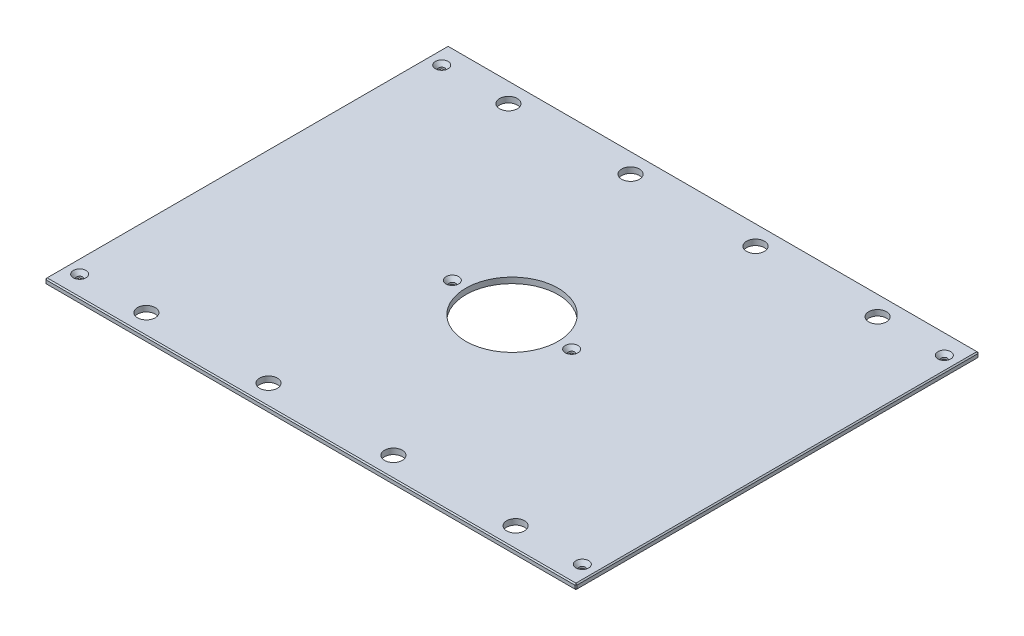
from build123d import *

# Parameters (mm, degrees)
SKETCH1_W                                     = 593.725
SKETCH1_H                                     = 450.85
BOSS_EXTRUDE1_DEPTH                           = 6.35
SKETCH13_R                                    = 51.562
CUT_EXTRUDE6_DEPTH                            = 373.805709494
F_25_32_0_78125_DIAMETER_HOLE1_D              = 19.84375
CHAMFER2_SIZE                                 = 1.27
CSK_FOR_1_4_FLAT_HEAD_MACHINE_SCREW1_AT_COUNT = 2
CSK_FOR_1_4_FLAT_HEAD_MACHINE_SCREW1_AT_PITCH = 404.80996
CSK_FOR_1_4_FLAT_HEAD_MACHINE_SCREW1_2_COUNT  = 2
CSK_FOR_1_4_FLAT_HEAD_MACHINE_SCREW1_2_PITCH  = 692.594401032
CSK_FOR_1_4_FLAT_HEAD_MACHINE_SCREW1_3_COUNT  = 2
CSK_FOR_1_4_FLAT_HEAD_MACHINE_SCREW1_3_PITCH  = 402.289683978
CSK_FOR_1_4_FLAT_HEAD_MACHINE_SCREW1_4_COUNT  = 2
CSK_FOR_1_4_FLAT_HEAD_MACHINE_SCREW1_4_PITCH  = 294.784028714
CSK_FOR_1_4_FLAT_HEAD_MACHINE_SCREW1_5_COUNT  = 2
CSK_FOR_1_4_FLAT_HEAD_MACHINE_SCREW1_5_PITCH  = 561.975
CSK_FOR_1_4_FLAT_HEAD_MACHINE_SCREW1_6_COUNT  = 2
CSK_FOR_1_4_FLAT_HEAD_MACHINE_SCREW1_6_PITCH  = 487.3625
CSK_FOR_1_4_FLAT_HEAD_MACHINE_SCREW1_7_COUNT  = 2
CSK_FOR_1_4_FLAT_HEAD_MACHINE_SCREW1_7_PITCH  = 633.556082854


with BuildPart() as part:
    # Sketch1 → Boss-Extrude1 (new body)
    with BuildSketch(Plane(origin=(0, 0, 0), x_dir=(1, 0, 0), z_dir=(0, 1, 0))):
        Rectangle(SKETCH1_W, SKETCH1_H)
    extrude(amount=BOSS_EXTRUDE1_DEPTH)

    # Sketch13 → Cut-Extrude6 (cut, through all)
    with BuildSketch(Plane(origin=(0, 6.35, 0), x_dir=(1, 0, 0), z_dir=(0, 1, 0))):
        with Locations(Location((0, 0, 0), (0, 0, 270))):
            Circle(SKETCH13_R)
    extrude(amount=-CUT_EXTRUDE6_DEPTH, mode=Mode.SUBTRACT)

    # 25_32 _0.78125_ Diameter Hole1 (through all)
    with Locations(Plane(origin=(0, 6.35, 0), x_dir=(1, 0, 0), z_dir=(0, 1, 0))):
        with Locations((206.375, 202.40498), (-206.375, 202.40498), (206.375, -202.40498), (-206.375, -202.40498), (-69.85, 202.40498), (69.85, 202.40498), (69.85, -202.40498), (-69.85, -202.40498)):
            Hole(F_25_32_0_78125_DIAMETER_HOLE1_D / 2)

    # Chamfer2
    chamfer2_edges = [part.edges().sort_by_distance(p)[0] for p in [
        (296.8625, 6.35, 0),
        (0, 6.35, -225.425),
        (-296.8625, 6.35, 0),
        (0, 0, -225.425),
        (296.8625, 0, 0),
        (0, 0, 225.425),
        (-296.8625, 0, 0),
        (0, 6.35, 225.425),
        (-296.8625, 3.175, -225.425),
        (296.8625, 3.175, -225.425),
        (296.8625, 3.175, 225.425),
        (-296.8625, 3.175, 225.425),
    ]]
    chamfer(chamfer2_edges, length=CHAMFER2_SIZE)

    # Sketch24 → CSK for 1_4 Flat Head Machine Screw1 (revolve, cut)
    with BuildSketch(Plane(origin=(280.9875, 6.35, -202.40498), x_dir=(0, 0, 1), z_dir=(1, 0, 0))):
        Polygon((0, 0), (0, 6.35), (3.3782, 6.35), (3.3782, 4.324464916), (7.1374, 0), align=None)
    csk_for_1_4_flat_head_machine_screw1 = revolve(axis=Axis((280.9875, 12.7, -202.40498), (0, -1, 0)), mode=Mode.SUBTRACT)

    # CSK for 1_4 Flat Head Machine Screw1 at: CSK for 1_4 Flat Head Machine Screw1 ×2
    with Locations(*[(0, 0, i * CSK_FOR_1_4_FLAT_HEAD_MACHINE_SCREW1_AT_PITCH) for i in range(1, CSK_FOR_1_4_FLAT_HEAD_MACHINE_SCREW1_AT_COUNT)]):
        add(csk_for_1_4_flat_head_machine_screw1, mode=Mode.SUBTRACT)

    # CSK for 1_4 Flat Head Machine Screw1 2: CSK for 1_4 Flat Head Machine Screw1 ×2
    with Locations(*[Vector(-0.8114056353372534, 0, 0.5844834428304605) * (i * CSK_FOR_1_4_FLAT_HEAD_MACHINE_SCREW1_2_PITCH) for i in range(1, CSK_FOR_1_4_FLAT_HEAD_MACHINE_SCREW1_2_COUNT)]):
        add(csk_for_1_4_flat_head_machine_screw1, mode=Mode.SUBTRACT)

    # CSK for 1_4 Flat Head Machine Screw1 3: CSK for 1_4 Flat Head Machine Screw1 ×2
    with Locations(*[Vector(-0.8642093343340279, 0, 0.5031324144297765) * (i * CSK_FOR_1_4_FLAT_HEAD_MACHINE_SCREW1_3_PITCH) for i in range(1, CSK_FOR_1_4_FLAT_HEAD_MACHINE_SCREW1_3_COUNT)]):
        add(csk_for_1_4_flat_head_machine_screw1, mode=Mode.SUBTRACT)

    # CSK for 1_4 Flat Head Machine Screw1 4: CSK for 1_4 Flat Head Machine Screw1 ×2
    with Locations(*[Vector(-0.7270153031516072, 0, 0.6866212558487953) * (i * CSK_FOR_1_4_FLAT_HEAD_MACHINE_SCREW1_4_PITCH) for i in range(1, CSK_FOR_1_4_FLAT_HEAD_MACHINE_SCREW1_4_COUNT)]):
        add(csk_for_1_4_flat_head_machine_screw1, mode=Mode.SUBTRACT)

    # CSK for 1_4 Flat Head Machine Screw1 5: CSK for 1_4 Flat Head Machine Screw1 ×2
    with Locations(*[(-i * CSK_FOR_1_4_FLAT_HEAD_MACHINE_SCREW1_5_PITCH, 0, 0) for i in range(1, CSK_FOR_1_4_FLAT_HEAD_MACHINE_SCREW1_5_COUNT)]):
        add(csk_for_1_4_flat_head_machine_screw1, mode=Mode.SUBTRACT)

    # CSK for 1_4 Flat Head Machine Screw1 6: CSK for 1_4 Flat Head Machine Screw1 ×2
    with Locations(*[(-i * CSK_FOR_1_4_FLAT_HEAD_MACHINE_SCREW1_6_PITCH, 0, 0) for i in range(1, CSK_FOR_1_4_FLAT_HEAD_MACHINE_SCREW1_6_COUNT)]):
        add(csk_for_1_4_flat_head_machine_screw1, mode=Mode.SUBTRACT)

    # CSK for 1_4 Flat Head Machine Screw1 7: CSK for 1_4 Flat Head Machine Screw1 ×2
    with Locations(*[Vector(-0.7692491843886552, 0, 0.6389488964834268) * (i * CSK_FOR_1_4_FLAT_HEAD_MACHINE_SCREW1_7_PITCH) for i in range(1, CSK_FOR_1_4_FLAT_HEAD_MACHINE_SCREW1_7_COUNT)]):
        add(csk_for_1_4_flat_head_machine_screw1, mode=Mode.SUBTRACT)


solid = part.part
